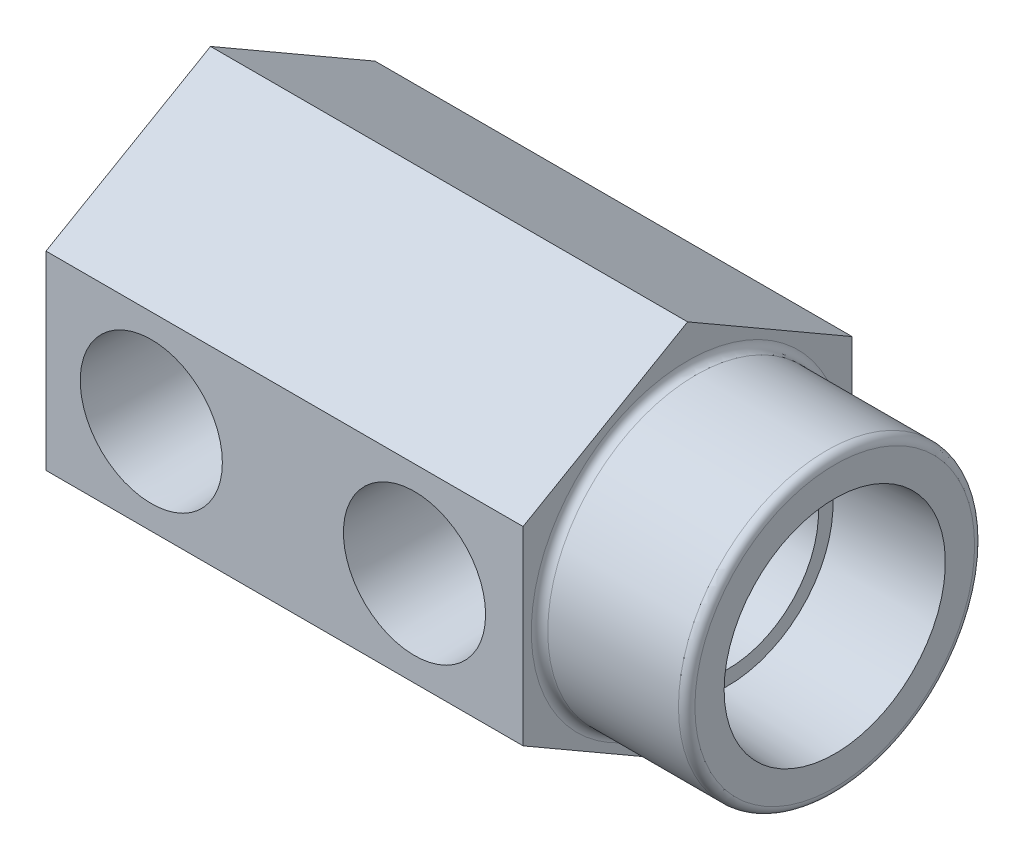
from build123d import *

# Parameters (mm, degrees)
BOSS_EXTRUDE1_DEPTH                  = 46.0375
SKETCH3_R                            = 14.2875
BOSS_EXTRUDE2_DEPTH                  = 14.1986
F_1_4_NPT_TAPPED_HOLE2_AT_2_COUNT    = 2
F_1_4_NPT_TAPPED_HOLE2_AT_2_PITCH    = 25.4
FILLET1_R                            = 0.79375
F_25_64_0_39063_DIAMETER_HOLE1_D     = 9.922002
F_25_64_0_39063_DIAMETER_HOLE1_DEPTH = 50.8
F_25_64_0_39063_DIAMETER_HOLE1_TIP   = 2.980870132
F_1_2_20_TAPPED_HOLE1_D              = 9.525
F_1_2_20_TAPPED_HOLE1_DEPTH          = 48.26
F_1_2_20_TAPPED_HOLE1_CBORE_D        = 12.7
F_1_2_20_TAPPED_HOLE1_CBORE_DEPTH    = 44.45
F_1_2_20_TAPPED_HOLE1_TIP            = 2.861598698


with BuildPart() as part:
    # Sketch2 → Boss-Extrude1 (new body)
    with BuildSketch(Plane(origin=(0, 0, 0), x_dir=(0, 0, -1), z_dir=(1, 0, 0))):
        Polygon((15.875, -9.165435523), (15.875, 9.165435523), (0, 18.330871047), (-15.875, 9.165435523), (-15.875, -9.165435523), (0, -18.330871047), align=None)
    extrude(amount=BOSS_EXTRUDE1_DEPTH)

    # Sketch3 → Boss-Extrude2 (add)
    with BuildSketch(Plane(origin=(46.0375, 0, 0), x_dir=(0, 0, -1), z_dir=(1, 0, 0))):
        with Locations(Location((0, 0, 0), (0, 0, 180))):
            Circle(SKETCH3_R)
    extrude(amount=BOSS_EXTRUDE2_DEPTH)

    # Sketch5 → Cut-Revolve1 (revolve, cut)
    with BuildSketch(Plane(origin=(0, 0, 0), x_dir=(1, 0, 0), z_dir=(0, 1, 0)), mode=Mode.PRIVATE) as cut_revolve1_sk:
        Polygon((49.9364, 8.73125), (36.1061, 8.73125), (36.1061, 0), (60.2361, 0), (60.2361, 10.674384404), (49.9364, 10.1346), align=None)
    revolve(cut_revolve1_sk.sketch.rotate(Axis((-14.001925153, 0, 0), (1, 0, 0)), 180), axis=Axis((-14.001925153, 0, 0), (1, 0, 0)), mode=Mode.SUBTRACT)

    # Sketch6 → 1_4 NPT Tapped Hole1 (revolve, cut)
    with BuildSketch(Plane(origin=(10.16, 0, -15.875), x_dir=(0, 1, 0), z_dir=(1, 0, 0))):
        Polygon((0, 0), (0, 23.586147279), (5.5626, 20.2438), (5.5626, 10.0203), (6.557978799, 10.0203), (6.858, 0), align=None)
    revolve(axis=Axis((10.16, 0, -22.225), (0, 0, 1)), mode=Mode.SUBTRACT)

    # Sketch8 → 1_4 NPT Tapped Hole2 (revolve, cut)
    with BuildSketch(Plane(origin=(10.16, 0, 15.875), x_dir=(0, -1, 0), z_dir=(1, 0, 0))):
        Polygon((0, 0), (0, 16.042347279), (5.5626, 12.7), (5.5626, 10.0203), (6.557978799, 10.0203), (6.858, 0), align=None)
    f_1_4_npt_tapped_hole2 = revolve(axis=Axis((10.16, 0, 22.225), (0, 0, -1)), mode=Mode.SUBTRACT)

    # 1_4 NPT Tapped Hole2 at 2: 1_4 NPT Tapped Hole2 ×2
    with Locations(*[(i * F_1_4_NPT_TAPPED_HOLE2_AT_2_PITCH, 0, 0) for i in range(1, F_1_4_NPT_TAPPED_HOLE2_AT_2_COUNT)]):
        add(f_1_4_npt_tapped_hole2, mode=Mode.SUBTRACT)

    # Fillet1
    fillet1_edges = [part.edges().sort_by_distance(p)[0] for p in [
        (46.0375, 0, -14.2875),
        (60.2361, 0, -14.2875),
    ]]
    fillet(fillet1_edges, radius=FILLET1_R)

    # 25_64 _0.39063_ Diameter Hole1
    with Locations(Plane(origin=(60.2361, 0, 0), x_dir=(0, 0, -1), z_dir=(1, 0, 0))):
        with Locations((0, 0)):
            Hole(F_25_64_0_39063_DIAMETER_HOLE1_D / 2, depth=F_25_64_0_39063_DIAMETER_HOLE1_DEPTH)
            with Locations((0, 0, -(F_25_64_0_39063_DIAMETER_HOLE1_DEPTH + F_25_64_0_39063_DIAMETER_HOLE1_TIP / 2))):  # 118° drill point
                Cone(0, F_25_64_0_39063_DIAMETER_HOLE1_D / 2, F_25_64_0_39063_DIAMETER_HOLE1_TIP, mode=Mode.SUBTRACT)

    # 1_2-20 Tapped Hole1
    with Locations(Plane(origin=(60.2361, 0, 0), x_dir=(0, 0, -1), z_dir=(1, 0, 0))):
        with Locations((0, 0)):
            CounterBoreHole(F_1_2_20_TAPPED_HOLE1_D / 2, F_1_2_20_TAPPED_HOLE1_CBORE_D / 2, F_1_2_20_TAPPED_HOLE1_CBORE_DEPTH, depth=F_1_2_20_TAPPED_HOLE1_DEPTH)
            with Locations((0, 0, -(F_1_2_20_TAPPED_HOLE1_DEPTH + F_1_2_20_TAPPED_HOLE1_TIP / 2))):  # 118° drill point
                Cone(0, F_1_2_20_TAPPED_HOLE1_D / 2, F_1_2_20_TAPPED_HOLE1_TIP, mode=Mode.SUBTRACT)


solid = part.part
